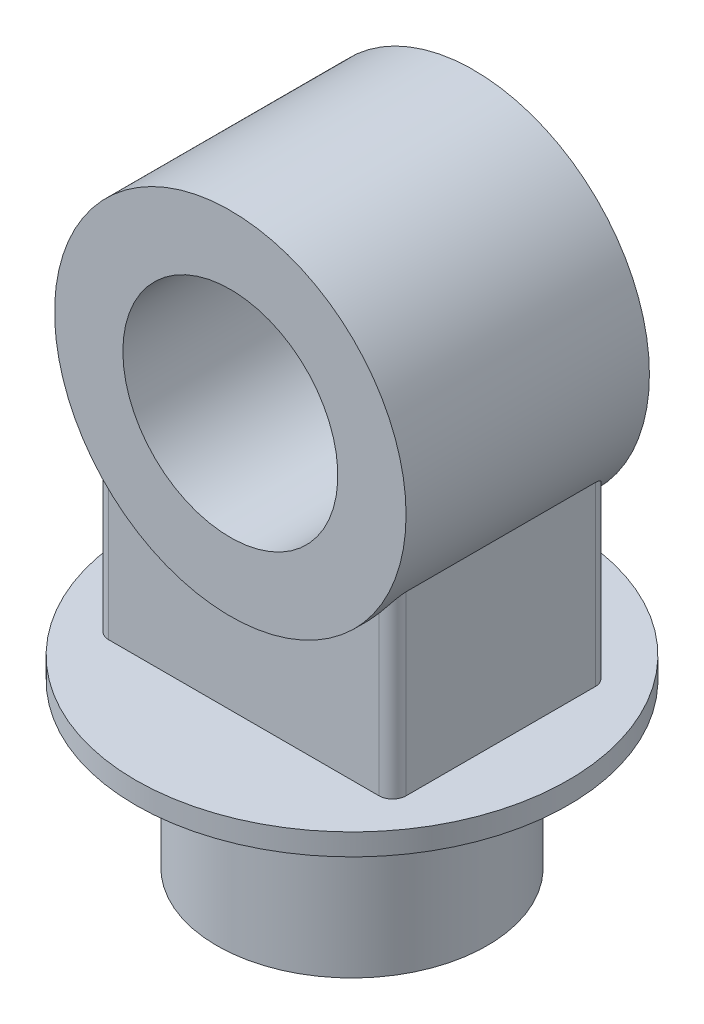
ISO-10303-21;
HEADER;
FILE_DESCRIPTION(('STEP AP214'),'2;1');
FILE_NAME('part.step','',(''),(''),'','','');
FILE_SCHEMA(('AUTOMOTIVE_DESIGN { 1 0 10303 214 1 1 1 1 }'));
ENDSEC;
DATA;
#1=APPLICATION_CONTEXT('core data for automotive mechanical design processes');
#2=APPLICATION_PROTOCOL_DEFINITION('international standard','automotive_design',2000,#1);
#3=PRODUCT_CONTEXT('',#1,'mechanical');
#4=PRODUCT('Part','Part','',(#3));
#5=PRODUCT_RELATED_PRODUCT_CATEGORY('part','',(#4));
#6=PRODUCT_DEFINITION_FORMATION('','',#4);
#7=PRODUCT_DEFINITION_CONTEXT('part definition',#1,'design');
#8=PRODUCT_DEFINITION('design','',#6,#7);
#9=PRODUCT_DEFINITION_SHAPE('','',#8);
#10=(LENGTH_UNIT() NAMED_UNIT(*) SI_UNIT(.MILLI.,.METRE.));
#11=(NAMED_UNIT(*) PLANE_ANGLE_UNIT() SI_UNIT($,.RADIAN.));
#12=(NAMED_UNIT(*) SI_UNIT($,.STERADIAN.) SOLID_ANGLE_UNIT());
#13=UNCERTAINTY_MEASURE_WITH_UNIT(LENGTH_MEASURE(1.E-05),#10,'distance_accuracy_value','');
#14=(GEOMETRIC_REPRESENTATION_CONTEXT(3) GLOBAL_UNCERTAINTY_ASSIGNED_CONTEXT((#13)) GLOBAL_UNIT_ASSIGNED_CONTEXT((#10,
#11,#12)) REPRESENTATION_CONTEXT('',''));
#15=CARTESIAN_POINT('',(0.,0.,0.));
#16=DIRECTION('',(0.,0.,1.));
#17=DIRECTION('',(1.,0.,0.));
#18=AXIS2_PLACEMENT_3D('',#15,#16,#17);
#19=CARTESIAN_POINT('',(0.,120.,0.));
#20=DIRECTION('',(0.,-1.,0.));
#21=DIRECTION('',(0.,0.,-1.));
#22=AXIS2_PLACEMENT_3D('',#19,#20,#21);
#23=CYLINDRICAL_SURFACE('',#22,100.);
#24=CARTESIAN_POINT('',(0.,120.,0.));
#25=DIRECTION('',(0.,1.,0.));
#26=DIRECTION('',(0.,0.,1.));
#27=AXIS2_PLACEMENT_3D('',#24,#25,#26);
#28=CIRCLE('',#27,100.);
#29=CARTESIAN_POINT('',(0.,120.,100.));
#30=VERTEX_POINT('',#29);
#31=EDGE_CURVE('E145',#30,#30,#28,.T.);
#32=ORIENTED_EDGE('',*,*,#31,.F.);
#33=EDGE_LOOP('',(#32));
#34=FACE_BOUND('',#33,.T.);
#35=CARTESIAN_POINT('',(0.,0.,0.));
#36=DIRECTION('',(0.,1.,0.));
#37=DIRECTION('',(0.,0.,1.));
#38=AXIS2_PLACEMENT_3D('',#35,#36,#37);
#39=CIRCLE('',#38,100.);
#40=CARTESIAN_POINT('',(0.,0.,100.));
#41=VERTEX_POINT('',#40);
#42=EDGE_CURVE('E231',#41,#41,#39,.T.);
#43=ORIENTED_EDGE('',*,*,#42,.T.);
#44=EDGE_LOOP('',(#43));
#45=FACE_BOUND('',#44,.T.);
#46=ADVANCED_FACE('F39',(#34,#45),#23,.T.);
#47=CARTESIAN_POINT('',(0.,0.,0.));
#48=DIRECTION('',(0.,1.,0.));
#49=DIRECTION('',(0.,0.,1.));
#50=AXIS2_PLACEMENT_3D('',#47,#48,#49);
#51=PLANE('',#50);
#52=ORIENTED_EDGE('',*,*,#42,.F.);
#53=EDGE_LOOP('',(#52));
#54=FACE_BOUND('',#53,.T.);
#55=ADVANCED_FACE('F243',(#54),#51,.F.);
#56=CARTESIAN_POINT('',(0.,136.,0.));
#57=DIRECTION('',(0.,-1.,0.));
#58=DIRECTION('',(0.,0.,-1.));
#59=AXIS2_PLACEMENT_3D('',#56,#57,#58);
#60=CYLINDRICAL_SURFACE('',#59,160.);
#61=CARTESIAN_POINT('',(0.,136.,0.));
#62=DIRECTION('',(0.,1.,0.));
#63=DIRECTION('',(0.,0.,1.));
#64=AXIS2_PLACEMENT_3D('',#61,#62,#63);
#65=CIRCLE('',#64,160.);
#66=CARTESIAN_POINT('',(0.,136.,160.));
#67=VERTEX_POINT('',#66);
#68=EDGE_CURVE('E227',#67,#67,#65,.T.);
#69=ORIENTED_EDGE('',*,*,#68,.F.);
#70=EDGE_LOOP('',(#69));
#71=FACE_BOUND('',#70,.T.);
#72=CARTESIAN_POINT('',(0.,120.,0.));
#73=DIRECTION('',(0.,1.,0.));
#74=DIRECTION('',(0.,0.,1.));
#75=AXIS2_PLACEMENT_3D('',#72,#73,#74);
#76=CIRCLE('',#75,160.);
#77=CARTESIAN_POINT('',(0.,120.,160.));
#78=VERTEX_POINT('',#77);
#79=EDGE_CURVE('E232',#78,#78,#76,.T.);
#80=ORIENTED_EDGE('',*,*,#79,.T.);
#81=EDGE_LOOP('',(#80));
#82=FACE_BOUND('',#81,.T.);
#83=ADVANCED_FACE('F245',(#71,#82),#60,.T.);
#84=CARTESIAN_POINT('',(0.,136.,0.));
#85=DIRECTION('',(0.,1.,0.));
#86=DIRECTION('',(0.,0.,1.));
#87=AXIS2_PLACEMENT_3D('',#84,#85,#86);
#88=PLANE('',#87);
#89=DIRECTION('',(0.,0.,-1.));
#90=VECTOR('',#89,1.);
#91=CARTESIAN_POINT('',(110.,136.,80.));
#92=LINE('',#91,#90);
#93=CARTESIAN_POINT('',(110.,136.,70.));
#94=VERTEX_POINT('',#93);
#95=CARTESIAN_POINT('',(110.,136.,-70.));
#96=VERTEX_POINT('',#95);
#97=EDGE_CURVE('E206',#94,#96,#92,.T.);
#98=ORIENTED_EDGE('',*,*,#97,.F.);
#99=CARTESIAN_POINT('',(99.9999999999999,136.,70.));
#100=DIRECTION('',(0.,1.,0.));
#101=DIRECTION('',(0.,0.,1.));
#102=AXIS2_PLACEMENT_3D('',#99,#100,#101);
#103=CIRCLE('',#102,10.);
#104=CARTESIAN_POINT('',(99.9999999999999,136.,80.));
#105=VERTEX_POINT('',#104);
#106=EDGE_CURVE('E54',#94,#105,#103,.F.);
#107=ORIENTED_EDGE('',*,*,#106,.T.);
#108=DIRECTION('',(1.,0.,0.));
#109=VECTOR('',#108,1.);
#110=CARTESIAN_POINT('',(-110.,136.,80.));
#111=LINE('',#110,#109);
#112=CARTESIAN_POINT('',(-100.,136.,80.));
#113=VERTEX_POINT('',#112);
#114=EDGE_CURVE('E205',#113,#105,#111,.T.);
#115=ORIENTED_EDGE('',*,*,#114,.F.);
#116=CARTESIAN_POINT('',(-100.,136.,70.));
#117=DIRECTION('',(0.,1.,0.));
#118=DIRECTION('',(0.,0.,1.));
#119=AXIS2_PLACEMENT_3D('',#116,#117,#118);
#120=CIRCLE('',#119,10.);
#121=CARTESIAN_POINT('',(-110.,136.,70.));
#122=VERTEX_POINT('',#121);
#123=EDGE_CURVE('E124',#113,#122,#120,.F.);
#124=ORIENTED_EDGE('',*,*,#123,.T.);
#125=DIRECTION('',(0.,0.,1.));
#126=VECTOR('',#125,1.);
#127=CARTESIAN_POINT('',(-110.,136.,80.));
#128=LINE('',#127,#126);
#129=CARTESIAN_POINT('',(-110.,136.,-70.));
#130=VERTEX_POINT('',#129);
#131=EDGE_CURVE('E208',#130,#122,#128,.T.);
#132=ORIENTED_EDGE('',*,*,#131,.F.);
#133=CARTESIAN_POINT('',(-100.,136.,-70.));
#134=DIRECTION('',(0.,1.,0.));
#135=DIRECTION('',(0.,0.,1.));
#136=AXIS2_PLACEMENT_3D('',#133,#134,#135);
#137=CIRCLE('',#136,10.);
#138=CARTESIAN_POINT('',(-100.,136.,-80.));
#139=VERTEX_POINT('',#138);
#140=EDGE_CURVE('E123',#130,#139,#137,.F.);
#141=ORIENTED_EDGE('',*,*,#140,.T.);
#142=DIRECTION('',(-1.,0.,0.));
#143=VECTOR('',#142,1.);
#144=CARTESIAN_POINT('',(-110.,136.,-80.));
#145=LINE('',#144,#143);
#146=CARTESIAN_POINT('',(99.9999999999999,136.,-80.));
#147=VERTEX_POINT('',#146);
#148=EDGE_CURVE('E273',#147,#139,#145,.T.);
#149=ORIENTED_EDGE('',*,*,#148,.F.);
#150=CARTESIAN_POINT('',(99.9999999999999,136.,-70.));
#151=DIRECTION('',(0.,1.,0.));
#152=DIRECTION('',(0.,0.,1.));
#153=AXIS2_PLACEMENT_3D('',#150,#151,#152);
#154=CIRCLE('',#153,10.);
#155=EDGE_CURVE('E61',#147,#96,#154,.F.);
#156=ORIENTED_EDGE('',*,*,#155,.T.);
#157=EDGE_LOOP('',(#98,#107,#115,#124,#132,#141,#149,#156));
#158=FACE_BOUND('',#157,.T.);
#159=ORIENTED_EDGE('',*,*,#68,.T.);
#160=EDGE_LOOP('',(#159));
#161=FACE_BOUND('',#160,.T.);
#162=ADVANCED_FACE('F203',(#158,#161),#88,.T.);
#163=CARTESIAN_POINT('',(0.,120.,0.));
#164=DIRECTION('',(0.,1.,0.));
#165=DIRECTION('',(0.,0.,1.));
#166=AXIS2_PLACEMENT_3D('',#163,#164,#165);
#167=PLANE('',#166);
#168=ORIENTED_EDGE('',*,*,#31,.T.);
#169=EDGE_LOOP('',(#168));
#170=FACE_BOUND('',#169,.T.);
#171=ORIENTED_EDGE('',*,*,#79,.F.);
#172=EDGE_LOOP('',(#171));
#173=FACE_BOUND('',#172,.T.);
#174=ADVANCED_FACE('F254',(#170,#173),#167,.F.);
#175=CARTESIAN_POINT('',(-110.,466.002,-80.));
#176=DIRECTION('',(0.,0.,1.));
#177=DIRECTION('',(1.,0.,0.));
#178=AXIS2_PLACEMENT_3D('',#175,#176,#177);
#179=PLANE('',#178);
#180=ORIENTED_EDGE('',*,*,#148,.T.);
#181=DIRECTION('',(0.,-1.,0.));
#182=VECTOR('',#181,1.);
#183=CARTESIAN_POINT('',(-100.,466.002,-80.));
#184=LINE('',#183,#182);
#185=CARTESIAN_POINT('',(-100.,252.933761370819,-80.));
#186=VERTEX_POINT('',#185);
#187=EDGE_CURVE('E155',#139,#186,#184,.F.);
#188=ORIENTED_EDGE('',*,*,#187,.T.);
#189=CARTESIAN_POINT('',(0.,336.,-80.));
#190=DIRECTION('',(0.,0.,1.));
#191=DIRECTION('',(1.,0.,0.));
#192=AXIS2_PLACEMENT_3D('',#189,#190,#191);
#193=CIRCLE('',#192,130.);
#194=CARTESIAN_POINT('',(99.9999999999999,252.933761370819,-80.));
#195=VERTEX_POINT('',#194);
#196=EDGE_CURVE('E218',#195,#186,#193,.F.);
#197=ORIENTED_EDGE('',*,*,#196,.F.);
#198=DIRECTION('',(0.,-1.,0.));
#199=VECTOR('',#198,1.);
#200=CARTESIAN_POINT('',(99.9999999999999,466.002,-80.));
#201=LINE('',#200,#199);
#202=EDGE_CURVE('E151',#195,#147,#201,.T.);
#203=ORIENTED_EDGE('',*,*,#202,.T.);
#204=EDGE_LOOP('',(#180,#188,#197,#203));
#205=FACE_BOUND('',#204,.T.);
#206=ADVANCED_FACE('F257',(#205),#179,.F.);
#207=CARTESIAN_POINT('',(110.,466.002,80.));
#208=DIRECTION('',(-1.,0.,0.));
#209=DIRECTION('',(0.,0.,1.));
#210=AXIS2_PLACEMENT_3D('',#207,#208,#209);
#211=PLANE('',#210);
#212=ORIENTED_EDGE('',*,*,#97,.T.);
#213=DIRECTION('',(0.,-1.,0.));
#214=VECTOR('',#213,1.);
#215=CARTESIAN_POINT('',(110.,466.002,-70.));
#216=LINE('',#215,#214);
#217=CARTESIAN_POINT('',(110.,266.717967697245,-70.));
#218=VERTEX_POINT('',#217);
#219=EDGE_CURVE('E161',#96,#218,#216,.F.);
#220=ORIENTED_EDGE('',*,*,#219,.T.);
#221=DIRECTION('',(0.,0.,-1.));
#222=VECTOR('',#221,1.);
#223=CARTESIAN_POINT('',(110.,266.717967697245,90.));
#224=LINE('',#223,#222);
#225=CARTESIAN_POINT('',(110.,266.717967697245,70.));
#226=VERTEX_POINT('',#225);
#227=EDGE_CURVE('E209',#226,#218,#224,.T.);
#228=ORIENTED_EDGE('',*,*,#227,.F.);
#229=DIRECTION('',(0.,-1.,0.));
#230=VECTOR('',#229,1.);
#231=CARTESIAN_POINT('',(110.,466.002,70.));
#232=LINE('',#231,#230);
#233=EDGE_CURVE('E158',#226,#94,#232,.T.);
#234=ORIENTED_EDGE('',*,*,#233,.T.);
#235=EDGE_LOOP('',(#212,#220,#228,#234));
#236=FACE_BOUND('',#235,.T.);
#237=ADVANCED_FACE('F215',(#236),#211,.F.);
#238=CARTESIAN_POINT('',(-110.,466.002,80.));
#239=DIRECTION('',(1.,0.,0.));
#240=DIRECTION('',(0.,0.,-1.));
#241=AXIS2_PLACEMENT_3D('',#238,#239,#240);
#242=PLANE('',#241);
#243=ORIENTED_EDGE('',*,*,#131,.T.);
#244=DIRECTION('',(0.,-1.,0.));
#245=VECTOR('',#244,1.);
#246=CARTESIAN_POINT('',(-110.,466.002,70.));
#247=LINE('',#246,#245);
#248=CARTESIAN_POINT('',(-110.,266.717967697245,70.));
#249=VERTEX_POINT('',#248);
#250=EDGE_CURVE('E143',#122,#249,#247,.F.);
#251=ORIENTED_EDGE('',*,*,#250,.T.);
#252=DIRECTION('',(0.,0.,-1.));
#253=VECTOR('',#252,1.);
#254=CARTESIAN_POINT('',(-110.,266.717967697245,90.));
#255=LINE('',#254,#253);
#256=CARTESIAN_POINT('',(-110.,266.717967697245,-70.));
#257=VERTEX_POINT('',#256);
#258=EDGE_CURVE('E118',#257,#249,#255,.F.);
#259=ORIENTED_EDGE('',*,*,#258,.F.);
#260=DIRECTION('',(0.,-1.,0.));
#261=VECTOR('',#260,1.);
#262=CARTESIAN_POINT('',(-110.,466.002,-70.));
#263=LINE('',#262,#261);
#264=EDGE_CURVE('E138',#257,#130,#263,.T.);
#265=ORIENTED_EDGE('',*,*,#264,.T.);
#266=EDGE_LOOP('',(#243,#251,#259,#265));
#267=FACE_BOUND('',#266,.T.);
#268=ADVANCED_FACE('F263',(#267),#242,.F.);
#269=CARTESIAN_POINT('',(-110.,466.002,80.));
#270=DIRECTION('',(0.,0.,-1.));
#271=DIRECTION('',(-1.,0.,0.));
#272=AXIS2_PLACEMENT_3D('',#269,#270,#271);
#273=PLANE('',#272);
#274=CARTESIAN_POINT('',(0.,336.,80.));
#275=DIRECTION('',(0.,0.,-1.));
#276=DIRECTION('',(-1.,0.,0.));
#277=AXIS2_PLACEMENT_3D('',#274,#275,#276);
#278=CIRCLE('',#277,130.);
#279=CARTESIAN_POINT('',(-100.,252.933761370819,80.));
#280=VERTEX_POINT('',#279);
#281=CARTESIAN_POINT('',(99.9999999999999,252.933761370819,80.));
#282=VERTEX_POINT('',#281);
#283=EDGE_CURVE('E115',#280,#282,#278,.F.);
#284=ORIENTED_EDGE('',*,*,#283,.F.);
#285=DIRECTION('',(0.,-1.,0.));
#286=VECTOR('',#285,1.);
#287=CARTESIAN_POINT('',(-100.,466.002,80.));
#288=LINE('',#287,#286);
#289=EDGE_CURVE('E130',#280,#113,#288,.T.);
#290=ORIENTED_EDGE('',*,*,#289,.T.);
#291=ORIENTED_EDGE('',*,*,#114,.T.);
#292=DIRECTION('',(0.,-1.,0.));
#293=VECTOR('',#292,1.);
#294=CARTESIAN_POINT('',(99.9999999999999,466.002,80.));
#295=LINE('',#294,#293);
#296=EDGE_CURVE('E132',#105,#282,#295,.F.);
#297=ORIENTED_EDGE('',*,*,#296,.T.);
#298=EDGE_LOOP('',(#284,#290,#291,#297));
#299=FACE_BOUND('',#298,.T.);
#300=ADVANCED_FACE('F128',(#299),#273,.F.);
#301=CARTESIAN_POINT('',(0.,336.,90.));
#302=DIRECTION('',(0.,0.,-1.));
#303=DIRECTION('',(-1.,0.,0.));
#304=AXIS2_PLACEMENT_3D('',#301,#302,#303);
#305=CYLINDRICAL_SURFACE('',#304,130.);
#306=CARTESIAN_POINT('',(0.,336.,90.));
#307=DIRECTION('',(0.,0.,1.));
#308=DIRECTION('',(1.,0.,0.));
#309=AXIS2_PLACEMENT_3D('',#306,#307,#308);
#310=CIRCLE('',#309,130.);
#311=CARTESIAN_POINT('',(130.,336.,90.));
#312=VERTEX_POINT('',#311);
#313=EDGE_CURVE('E134',#312,#312,#310,.T.);
#314=ORIENTED_EDGE('',*,*,#313,.F.);
#315=EDGE_LOOP('',(#314));
#316=FACE_BOUND('',#315,.T.);
#317=CARTESIAN_POINT('',(0.,336.,-90.));
#318=DIRECTION('',(0.,0.,1.));
#319=DIRECTION('',(1.,0.,0.));
#320=AXIS2_PLACEMENT_3D('',#317,#318,#319);
#321=CIRCLE('',#320,130.);
#322=CARTESIAN_POINT('',(130.,336.,-90.));
#323=VERTEX_POINT('',#322);
#324=EDGE_CURVE('E286',#323,#323,#321,.T.);
#325=ORIENTED_EDGE('',*,*,#324,.T.);
#326=EDGE_LOOP('',(#325));
#327=FACE_BOUND('',#326,.T.);
#328=ORIENTED_EDGE('',*,*,#283,.T.);
#329=CARTESIAN_POINT('',(99.9999999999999,252.933761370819,80.));
#330=CARTESIAN_POINT('',(100.223611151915,253.202952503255,79.9999830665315));
#331=CARTESIAN_POINT('',(100.446118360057,253.473036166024,79.9924995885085));
#332=CARTESIAN_POINT('',(100.888548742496,254.014496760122,79.9629173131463));
#333=CARTESIAN_POINT('',(101.108472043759,254.285873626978,79.9408192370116));
#334=CARTESIAN_POINT('',(101.545586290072,254.829711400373,79.8822979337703));
#335=CARTESIAN_POINT('',(101.76277446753,255.102173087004,79.8458612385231));
#336=CARTESIAN_POINT('',(102.193849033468,255.647413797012,79.7588609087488));
#337=CARTESIAN_POINT('',(102.407735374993,255.920192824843,79.7082970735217));
#338=CARTESIAN_POINT('',(103.048408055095,256.74400885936,79.5343891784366));
#339=CARTESIAN_POINT('',(103.469748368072,257.294974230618,79.3894263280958));
#340=CARTESIAN_POINT('',(104.088382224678,258.11722484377,79.1288060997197));
#341=CARTESIAN_POINT('',(104.292337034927,258.39057162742,79.0347525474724));
#342=CARTESIAN_POINT('',(104.695498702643,258.935304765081,78.8319429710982));
#343=CARTESIAN_POINT('',(104.894706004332,259.206691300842,78.7231883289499));
#344=CARTESIAN_POINT('',(105.336170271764,259.812965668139,78.4620472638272));
#345=CARTESIAN_POINT('',(105.577006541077,260.147108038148,78.3055009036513));
#346=CARTESIAN_POINT('',(106.04966094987,260.809343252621,77.967808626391));
#347=CARTESIAN_POINT('',(106.281479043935,261.137436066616,77.7866625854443));
#348=CARTESIAN_POINT('',(106.734152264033,261.784259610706,77.3986376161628));
#349=CARTESIAN_POINT('',(106.955036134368,262.103013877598,77.1918317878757));
#350=CARTESIAN_POINT('',(107.384708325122,262.728803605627,76.749894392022));
#351=CARTESIAN_POINT('',(107.593501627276,263.035843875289,76.5147746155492));
#352=CARTESIAN_POINT('',(107.921279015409,263.522080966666,76.1068757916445));
#353=CARTESIAN_POINT('',(108.044709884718,263.706240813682,75.9435605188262));
#354=CARTESIAN_POINT('',(108.284949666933,264.066582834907,75.6038296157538));
#355=CARTESIAN_POINT('',(108.401760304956,264.242767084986,75.4274174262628));
#356=CARTESIAN_POINT('',(108.627683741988,264.585236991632,75.0605773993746));
#357=CARTESIAN_POINT('',(108.736797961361,264.751524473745,74.8701521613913));
#358=CARTESIAN_POINT('',(108.945874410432,265.071634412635,74.4745306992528));
#359=CARTESIAN_POINT('',(109.04583974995,265.225461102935,74.2693395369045));
#360=CARTESIAN_POINT('',(109.274660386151,265.579056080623,73.7536743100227));
#361=CARTESIAN_POINT('',(109.398046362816,265.771031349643,73.4351396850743));
#362=CARTESIAN_POINT('',(109.561336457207,266.026263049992,72.9345418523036));
#363=CARTESIAN_POINT('',(109.612072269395,266.105785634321,72.7641622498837));
#364=CARTESIAN_POINT('',(109.705421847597,266.25239837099,72.4160328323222));
#365=CARTESIAN_POINT('',(109.748040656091,266.319496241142,72.2382876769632));
#366=CARTESIAN_POINT('',(109.820262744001,266.433384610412,71.8947331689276));
#367=CARTESIAN_POINT('',(109.850752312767,266.481551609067,71.729567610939));
#368=CARTESIAN_POINT('',(109.903691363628,266.565274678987,71.3948451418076));
#369=CARTESIAN_POINT('',(109.926143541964,266.600834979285,71.2252897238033));
#370=CARTESIAN_POINT('',(109.962659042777,266.658707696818,70.8807814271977));
#371=CARTESIAN_POINT('',(109.976613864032,266.680848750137,70.7057875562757));
#372=CARTESIAN_POINT('',(109.99061964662,266.703076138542,70.4419386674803));
#373=CARTESIAN_POINT('',(109.99413386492,266.708654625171,70.3536902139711));
#374=CARTESIAN_POINT('',(109.998824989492,266.716102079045,70.1769662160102));
#375=CARTESIAN_POINT('',(110.000001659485,266.717970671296,70.088490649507));
#376=CARTESIAN_POINT('',(110.,266.717967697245,70.));
#377=B_SPLINE_CURVE_WITH_KNOTS('',3,(#329,#330,#331,#332,#333,#334,#335,#336,#337,#338,#339,
#340,#341,#342,#343,#344,#345,#346,#347,#348,#349,#350,#351,#352,#353,#354,#355,#356,#357,#358,
#359,#360,#361,#362,#363,#364,#365,#366,#367,#368,#369,#370,#371,#372,#373,#374,#375,#376),
.UNSPECIFIED.,.F.,.F.,(4,2,2,2,2,2,2,2,2,2,2,2,2,2,2,2,2,2,2,2,2,2,2,4),(0.,1.04974156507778,
2.09943133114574,3.15010942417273,4.20080244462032,6.32356278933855,7.38465211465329,
8.44564176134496,9.76677685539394,11.087918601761,12.4053795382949,13.7222937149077,
14.5479419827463,15.3733741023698,16.1986534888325,17.0236513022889,18.1946866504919,
18.7783719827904,19.3616935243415,19.8852298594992,20.408590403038,20.9385006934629,
21.2038887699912,21.4693036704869),.UNSPECIFIED.);
#378=EDGE_CURVE('E11',#282,#226,#377,.T.);
#379=ORIENTED_EDGE('',*,*,#378,.T.);
#380=ORIENTED_EDGE('',*,*,#227,.T.);
#381=CARTESIAN_POINT('',(110.,266.717967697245,-70.));
#382=CARTESIAN_POINT('',(110.000033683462,266.718025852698,-70.1614230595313));
#383=CARTESIAN_POINT('',(109.996092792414,266.711764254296,-70.3228118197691));
#384=CARTESIAN_POINT('',(109.980519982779,266.687045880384,-70.6441123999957));
#385=CARTESIAN_POINT('',(109.968896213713,266.668602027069,-70.8040256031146));
#386=CARTESIAN_POINT('',(109.938376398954,266.620217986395,-71.1196424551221));
#387=CARTESIAN_POINT('',(109.919558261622,266.590400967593,-71.2753727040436));
#388=CARTESIAN_POINT('',(109.875071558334,266.52000006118,-71.5834085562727));
#389=CARTESIAN_POINT('',(109.849400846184,266.479412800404,-71.7357130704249));
#390=CARTESIAN_POINT('',(109.784772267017,266.377386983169,-72.0722520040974));
#391=CARTESIAN_POINT('',(109.744103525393,266.313281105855,-72.2553511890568));
#392=CARTESIAN_POINT('',(109.654040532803,266.171650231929,-72.6141464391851));
#393=CARTESIAN_POINT('',(109.604640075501,266.094115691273,-72.7898371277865));
#394=CARTESIAN_POINT('',(109.497968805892,265.927147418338,-73.133872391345));
#395=CARTESIAN_POINT('',(109.440667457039,265.837667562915,-73.302184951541));
#396=CARTESIAN_POINT('',(109.319341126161,265.648779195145,-73.6304969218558));
#397=CARTESIAN_POINT('',(109.25531768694,265.549372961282,-73.7904982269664));
#398=CARTESIAN_POINT('',(109.085069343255,265.285901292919,-74.1868876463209));
#399=CARTESIAN_POINT('',(108.974781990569,265.115997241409,-74.4176642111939));
#400=CARTESIAN_POINT('',(108.742772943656,264.76058359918,-74.8607110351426));
#401=CARTESIAN_POINT('',(108.621044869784,264.575065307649,-75.072970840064));
#402=CARTESIAN_POINT('',(108.36794946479,264.19164129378,-75.4804206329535));
#403=CARTESIAN_POINT('',(108.236568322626,263.993717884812,-75.6755852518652));
#404=CARTESIAN_POINT('',(107.965814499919,263.588382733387,-76.0497203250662));
#405=CARTESIAN_POINT('',(107.826442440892,263.380971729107,-76.2286920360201));
#406=CARTESIAN_POINT('',(107.56145650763,262.989174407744,-76.5468161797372));
#407=CARTESIAN_POINT('',(107.436764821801,262.805791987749,-76.6879854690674));
#408=CARTESIAN_POINT('',(107.182869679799,262.434497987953,-76.9599552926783));
#409=CARTESIAN_POINT('',(107.053665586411,262.24658576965,-77.0907543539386));
#410=CARTESIAN_POINT('',(106.659844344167,261.677121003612,-77.4685356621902));
#411=CARTESIAN_POINT('',(106.389102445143,261.289965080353,-77.7008024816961));
#412=CARTESIAN_POINT('',(105.833418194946,260.504836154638,-78.129863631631));
#413=CARTESIAN_POINT('',(105.548442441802,260.106838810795,-78.3265689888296));
#414=CARTESIAN_POINT('',(104.96676628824,259.304344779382,-78.6860846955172));
#415=CARTESIAN_POINT('',(104.670068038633,258.899849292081,-78.8489012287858));
#416=CARTESIAN_POINT('',(104.024574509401,258.030646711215,-79.1623550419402));
#417=CARTESIAN_POINT('',(103.674248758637,257.565348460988,-79.3081944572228));
#418=CARTESIAN_POINT('',(102.961876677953,256.632523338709,-79.558756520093));
#419=CARTESIAN_POINT('',(102.599828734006,256.16499616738,-79.6634734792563));
#420=CARTESIAN_POINT('',(102.051092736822,255.466397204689,-79.7891645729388));
#421=CARTESIAN_POINT('',(101.868137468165,255.235094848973,-79.8257282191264));
#422=CARTESIAN_POINT('',(101.499966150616,254.77288550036,-79.8886289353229));
#423=CARTESIAN_POINT('',(101.314750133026,254.541978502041,-79.9149661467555));
#424=CARTESIAN_POINT('',(100.942320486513,254.080919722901,-79.9572665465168));
#425=CARTESIAN_POINT('',(100.755107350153,253.850767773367,-79.9732322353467));
#426=CARTESIAN_POINT('',(100.378860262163,253.391449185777,-79.9945948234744));
#427=CARTESIAN_POINT('',(100.189826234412,253.162282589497,-79.9999912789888));
#428=CARTESIAN_POINT('',(99.9999999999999,252.933761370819,-80.));
#429=B_SPLINE_CURVE_WITH_KNOTS('',3,(#381,#382,#383,#384,#385,#386,#387,#388,#389,#390,#391,
#392,#393,#394,#395,#396,#397,#398,#399,#400,#401,#402,#403,#404,#405,#406,#407,#408,#409,#410,
#411,#412,#413,#414,#415,#416,#417,#418,#419,#420,#421,#422,#423,#424,#425,#426,#427,#428),
.UNSPECIFIED.,.F.,.F.,(4,2,2,2,2,2,2,2,2,2,2,2,2,2,2,2,2,2,2,2,2,2,2,4),(0.,0.484045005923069,
0.967577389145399,1.44601544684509,1.92460352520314,2.51835043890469,3.11252108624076,
3.7090561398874,4.30545457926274,5.22516595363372,6.1453932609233,7.06696382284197,
7.98846280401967,8.77680092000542,9.56525081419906,11.1426900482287,12.7240229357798,
14.305067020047,16.1047501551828,17.9046821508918,18.7960435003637,19.6873925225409,
20.5785265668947,21.4696980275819),.UNSPECIFIED.);
#430=EDGE_CURVE('E196',#218,#195,#429,.T.);
#431=ORIENTED_EDGE('',*,*,#430,.T.);
#432=ORIENTED_EDGE('',*,*,#196,.T.);
#433=CARTESIAN_POINT('',(-100.,252.933761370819,-80.));
#434=CARTESIAN_POINT('',(-100.223611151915,253.202952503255,-79.9999830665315));
#435=CARTESIAN_POINT('',(-100.446118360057,253.473036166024,-79.9924995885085));
#436=CARTESIAN_POINT('',(-100.888548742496,254.014496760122,-79.9629173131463));
#437=CARTESIAN_POINT('',(-101.10847204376,254.285873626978,-79.9408192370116));
#438=CARTESIAN_POINT('',(-101.545586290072,254.829711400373,-79.8822979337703));
#439=CARTESIAN_POINT('',(-101.76277446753,255.102173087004,-79.8458612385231));
#440=CARTESIAN_POINT('',(-102.193849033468,255.647413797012,-79.7588609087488));
#441=CARTESIAN_POINT('',(-102.407735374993,255.920192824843,-79.7082970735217));
#442=CARTESIAN_POINT('',(-103.048408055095,256.74400885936,-79.5343891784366));
#443=CARTESIAN_POINT('',(-103.469748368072,257.294974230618,-79.3894263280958));
#444=CARTESIAN_POINT('',(-104.088382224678,258.117224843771,-79.1288060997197));
#445=CARTESIAN_POINT('',(-104.292337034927,258.390571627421,-79.0347525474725));
#446=CARTESIAN_POINT('',(-104.695498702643,258.935304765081,-78.8319429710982));
#447=CARTESIAN_POINT('',(-104.894706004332,259.206691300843,-78.7231883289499));
#448=CARTESIAN_POINT('',(-105.336170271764,259.812965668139,-78.4620472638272));
#449=CARTESIAN_POINT('',(-105.577006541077,260.147108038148,-78.3055009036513));
#450=CARTESIAN_POINT('',(-106.049660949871,260.809343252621,-77.967808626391));
#451=CARTESIAN_POINT('',(-106.281479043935,261.137436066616,-77.7866625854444));
#452=CARTESIAN_POINT('',(-106.734152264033,261.784259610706,-77.3986376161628));
#453=CARTESIAN_POINT('',(-106.955036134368,262.103013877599,-77.1918317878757));
#454=CARTESIAN_POINT('',(-107.384708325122,262.728803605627,-76.749894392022));
#455=CARTESIAN_POINT('',(-107.593501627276,263.035843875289,-76.5147746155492));
#456=CARTESIAN_POINT('',(-107.921279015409,263.522080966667,-76.1068757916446));
#457=CARTESIAN_POINT('',(-108.044709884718,263.706240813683,-75.9435605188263));
#458=CARTESIAN_POINT('',(-108.284949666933,264.066582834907,-75.6038296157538));
#459=CARTESIAN_POINT('',(-108.401760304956,264.242767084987,-75.4274174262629));
#460=CARTESIAN_POINT('',(-108.627683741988,264.585236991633,-75.0605773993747));
#461=CARTESIAN_POINT('',(-108.736797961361,264.751524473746,-74.8701521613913));
#462=CARTESIAN_POINT('',(-108.945874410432,265.071634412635,-74.4745306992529));
#463=CARTESIAN_POINT('',(-109.04583974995,265.225461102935,-74.2693395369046));
#464=CARTESIAN_POINT('',(-109.274660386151,265.579056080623,-73.7536743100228));
#465=CARTESIAN_POINT('',(-109.398046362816,265.771031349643,-73.4351396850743));
#466=CARTESIAN_POINT('',(-109.561336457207,266.026263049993,-72.9345418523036));
#467=CARTESIAN_POINT('',(-109.612072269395,266.105785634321,-72.7641622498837));
#468=CARTESIAN_POINT('',(-109.705421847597,266.25239837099,-72.4160328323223));
#469=CARTESIAN_POINT('',(-109.748040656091,266.319496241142,-72.2382876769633));
#470=CARTESIAN_POINT('',(-109.820262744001,266.433384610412,-71.8947331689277));
#471=CARTESIAN_POINT('',(-109.850752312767,266.481551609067,-71.729567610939));
#472=CARTESIAN_POINT('',(-109.903691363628,266.565274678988,-71.3948451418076));
#473=CARTESIAN_POINT('',(-109.926143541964,266.600834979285,-71.2252897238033));
#474=CARTESIAN_POINT('',(-109.962659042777,266.658707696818,-70.8807814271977));
#475=CARTESIAN_POINT('',(-109.976613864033,266.680848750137,-70.7057875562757));
#476=CARTESIAN_POINT('',(-109.99061964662,266.703076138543,-70.4419386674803));
#477=CARTESIAN_POINT('',(-109.99413386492,266.708654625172,-70.3536902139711));
#478=CARTESIAN_POINT('',(-109.998824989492,266.716102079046,-70.1769662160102));
#479=CARTESIAN_POINT('',(-110.000001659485,266.717970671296,-70.0884906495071));
#480=CARTESIAN_POINT('',(-110.,266.717967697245,-70.));
#481=B_SPLINE_CURVE_WITH_KNOTS('',3,(#433,#434,#435,#436,#437,#438,#439,#440,#441,#442,#443,
#444,#445,#446,#447,#448,#449,#450,#451,#452,#453,#454,#455,#456,#457,#458,#459,#460,#461,#462,
#463,#464,#465,#466,#467,#468,#469,#470,#471,#472,#473,#474,#475,#476,#477,#478,#479,#480),
.UNSPECIFIED.,.F.,.F.,(4,2,2,2,2,2,2,2,2,2,2,2,2,2,2,2,2,2,2,2,2,2,2,4),(0.,1.04974156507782,
2.09943133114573,3.15010942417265,4.20080244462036,6.32356278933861,7.38465211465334,
8.44564176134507,9.76677685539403,11.087918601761,12.4053795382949,13.7222937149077,
14.5479419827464,15.3733741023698,16.1986534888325,17.0236513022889,18.1946866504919,
18.7783719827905,19.3616935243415,19.8852298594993,20.4085904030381,20.9385006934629,
21.2038887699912,21.4693036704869),.UNSPECIFIED.);
#482=EDGE_CURVE('E187',#186,#257,#481,.T.);
#483=ORIENTED_EDGE('',*,*,#482,.T.);
#484=ORIENTED_EDGE('',*,*,#258,.T.);
#485=CARTESIAN_POINT('',(-110.,266.717967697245,70.));
#486=CARTESIAN_POINT('',(-110.000033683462,266.718025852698,70.1614230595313));
#487=CARTESIAN_POINT('',(-109.996092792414,266.711764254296,70.3228118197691));
#488=CARTESIAN_POINT('',(-109.980519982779,266.687045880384,70.6441123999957));
#489=CARTESIAN_POINT('',(-109.968896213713,266.668602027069,70.8040256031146));
#490=CARTESIAN_POINT('',(-109.938376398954,266.620217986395,71.1196424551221));
#491=CARTESIAN_POINT('',(-109.919558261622,266.590400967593,71.2753727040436));
#492=CARTESIAN_POINT('',(-109.875071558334,266.52000006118,71.5834085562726));
#493=CARTESIAN_POINT('',(-109.849400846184,266.479412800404,71.7357130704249));
#494=CARTESIAN_POINT('',(-109.784772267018,266.377386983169,72.0722520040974));
#495=CARTESIAN_POINT('',(-109.744103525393,266.313281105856,72.2553511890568));
#496=CARTESIAN_POINT('',(-109.654040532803,266.17165023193,72.6141464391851));
#497=CARTESIAN_POINT('',(-109.604640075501,266.094115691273,72.7898371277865));
#498=CARTESIAN_POINT('',(-109.497968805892,265.927147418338,73.1338723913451));
#499=CARTESIAN_POINT('',(-109.440667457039,265.837667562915,73.3021849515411));
#500=CARTESIAN_POINT('',(-109.319341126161,265.648779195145,73.6304969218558));
#501=CARTESIAN_POINT('',(-109.25531768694,265.549372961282,73.7904982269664));
#502=CARTESIAN_POINT('',(-109.085069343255,265.28590129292,74.1868876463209));
#503=CARTESIAN_POINT('',(-108.974781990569,265.115997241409,74.4176642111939));
#504=CARTESIAN_POINT('',(-108.742772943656,264.76058359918,74.8607110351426));
#505=CARTESIAN_POINT('',(-108.621044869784,264.575065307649,75.072970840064));
#506=CARTESIAN_POINT('',(-108.36794946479,264.19164129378,75.4804206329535));
#507=CARTESIAN_POINT('',(-108.236568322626,263.993717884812,75.6755852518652));
#508=CARTESIAN_POINT('',(-107.965814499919,263.588382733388,76.0497203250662));
#509=CARTESIAN_POINT('',(-107.826442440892,263.380971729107,76.2286920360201));
#510=CARTESIAN_POINT('',(-107.56145650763,262.989174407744,76.5468161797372));
#511=CARTESIAN_POINT('',(-107.436764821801,262.805791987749,76.6879854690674));
#512=CARTESIAN_POINT('',(-107.182869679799,262.434497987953,76.9599552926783));
#513=CARTESIAN_POINT('',(-107.053665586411,262.24658576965,77.0907543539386));
#514=CARTESIAN_POINT('',(-106.659844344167,261.677121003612,77.4685356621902));
#515=CARTESIAN_POINT('',(-106.389102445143,261.289965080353,77.7008024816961));
#516=CARTESIAN_POINT('',(-105.833418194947,260.504836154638,78.129863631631));
#517=CARTESIAN_POINT('',(-105.548442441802,260.106838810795,78.3265689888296));
#518=CARTESIAN_POINT('',(-104.96676628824,259.304344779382,78.6860846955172));
#519=CARTESIAN_POINT('',(-104.670068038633,258.899849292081,78.8489012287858));
#520=CARTESIAN_POINT('',(-104.024574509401,258.030646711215,79.1623550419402));
#521=CARTESIAN_POINT('',(-103.674248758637,257.565348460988,79.3081944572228));
#522=CARTESIAN_POINT('',(-102.961876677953,256.632523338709,79.558756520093));
#523=CARTESIAN_POINT('',(-102.599828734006,256.16499616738,79.6634734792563));
#524=CARTESIAN_POINT('',(-102.051092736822,255.46639720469,79.7891645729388));
#525=CARTESIAN_POINT('',(-101.868137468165,255.235094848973,79.8257282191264));
#526=CARTESIAN_POINT('',(-101.499966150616,254.772885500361,79.8886289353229));
#527=CARTESIAN_POINT('',(-101.314750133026,254.541978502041,79.9149661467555));
#528=CARTESIAN_POINT('',(-100.942320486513,254.080919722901,79.9572665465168));
#529=CARTESIAN_POINT('',(-100.755107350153,253.850767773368,79.9732322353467));
#530=CARTESIAN_POINT('',(-100.378860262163,253.391449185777,79.9945948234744));
#531=CARTESIAN_POINT('',(-100.189826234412,253.162282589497,79.9999912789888));
#532=CARTESIAN_POINT('',(-100.,252.933761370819,80.));
#533=B_SPLINE_CURVE_WITH_KNOTS('',3,(#485,#486,#487,#488,#489,#490,#491,#492,#493,#494,#495,
#496,#497,#498,#499,#500,#501,#502,#503,#504,#505,#506,#507,#508,#509,#510,#511,#512,#513,#514,
#515,#516,#517,#518,#519,#520,#521,#522,#523,#524,#525,#526,#527,#528,#529,#530,#531,#532),
.UNSPECIFIED.,.F.,.F.,(4,2,2,2,2,2,2,2,2,2,2,2,2,2,2,2,2,2,2,2,2,2,2,4),(0.,0.484045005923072,
0.967577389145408,1.44601544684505,1.92460352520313,2.51835043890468,3.11252108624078,
3.70905613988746,4.30545457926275,5.22516595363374,6.14539326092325,7.06696382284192,
7.98846280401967,8.7768009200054,9.565250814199,11.1426900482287,12.7240229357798,
14.3050670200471,16.1047501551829,17.9046821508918,18.7960435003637,19.6873925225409,
20.5785265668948,21.4696980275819),.UNSPECIFIED.);
#534=EDGE_CURVE('E112',#249,#280,#533,.T.);
#535=ORIENTED_EDGE('',*,*,#534,.T.);
#536=EDGE_LOOP('',(#328,#379,#380,#431,#432,#483,#484,#535));
#537=FACE_BOUND('',#536,.T.);
#538=ADVANCED_FACE('F114',(#316,#327,#537),#305,.T.);
#539=CARTESIAN_POINT('',(0.,336.,90.));
#540=DIRECTION('',(0.,0.,1.));
#541=DIRECTION('',(1.,0.,0.));
#542=AXIS2_PLACEMENT_3D('',#539,#540,#541);
#543=PLANE('',#542);
#544=ORIENTED_EDGE('',*,*,#313,.T.);
#545=EDGE_LOOP('',(#544));
#546=FACE_BOUND('',#545,.T.);
#547=CARTESIAN_POINT('',(0.,336.,90.));
#548=DIRECTION('',(0.,0.,1.));
#549=DIRECTION('',(1.,0.,0.));
#550=AXIS2_PLACEMENT_3D('',#547,#548,#549);
#551=CIRCLE('',#550,79.5);
#552=CARTESIAN_POINT('',(-79.5,336.,90.));
#553=VERTEX_POINT('',#552);
#554=EDGE_CURVE('E407',#553,#553,#551,.T.);
#555=ORIENTED_EDGE('',*,*,#554,.F.);
#556=EDGE_LOOP('',(#555));
#557=FACE_BOUND('',#556,.T.);
#558=ADVANCED_FACE('F323',(#546,#557),#543,.T.);
#559=CARTESIAN_POINT('',(0.,336.,-90.));
#560=DIRECTION('',(0.,0.,1.));
#561=DIRECTION('',(1.,0.,0.));
#562=AXIS2_PLACEMENT_3D('',#559,#560,#561);
#563=PLANE('',#562);
#564=ORIENTED_EDGE('',*,*,#324,.F.);
#565=EDGE_LOOP('',(#564));
#566=FACE_BOUND('',#565,.T.);
#567=CARTESIAN_POINT('',(0.,336.,-90.));
#568=DIRECTION('',(0.,0.,1.));
#569=DIRECTION('',(1.,0.,0.));
#570=AXIS2_PLACEMENT_3D('',#567,#568,#569);
#571=CIRCLE('',#570,79.5);
#572=CARTESIAN_POINT('',(-79.5,336.,-90.));
#573=VERTEX_POINT('',#572);
#574=EDGE_CURVE('E409',#573,#573,#571,.T.);
#575=ORIENTED_EDGE('',*,*,#574,.T.);
#576=EDGE_LOOP('',(#575));
#577=FACE_BOUND('',#576,.T.);
#578=ADVANCED_FACE('F362',(#566,#577),#563,.F.);
#579=CARTESIAN_POINT('',(0.,336.,90.));
#580=DIRECTION('',(0.,0.,-1.));
#581=DIRECTION('',(-1.,0.,0.));
#582=AXIS2_PLACEMENT_3D('',#579,#580,#581);
#583=CYLINDRICAL_SURFACE('',#582,79.5);
#584=CARTESIAN_POINT('',(-79.5,336.,90.));
#585=CARTESIAN_POINT('',(-79.5,336.,88.125));
#586=CARTESIAN_POINT('',(-79.5,336.,86.25));
#587=CARTESIAN_POINT('',(-79.5,336.,82.5));
#588=CARTESIAN_POINT('',(-79.5,336.,80.625));
#589=CARTESIAN_POINT('',(-79.5,336.,76.875));
#590=CARTESIAN_POINT('',(-79.5,336.,75.));
#591=CARTESIAN_POINT('',(-79.5,336.,71.25));
#592=CARTESIAN_POINT('',(-79.5,336.,69.375));
#593=CARTESIAN_POINT('',(-79.5,336.,65.625));
#594=CARTESIAN_POINT('',(-79.5,336.,63.75));
#595=CARTESIAN_POINT('',(-79.5,336.,60.));
#596=CARTESIAN_POINT('',(-79.5,336.,58.125));
#597=CARTESIAN_POINT('',(-79.5,336.,54.375));
#598=CARTESIAN_POINT('',(-79.5,336.,52.5));
#599=CARTESIAN_POINT('',(-79.5,336.,48.75));
#600=CARTESIAN_POINT('',(-79.5,336.,46.875));
#601=CARTESIAN_POINT('',(-79.5,336.,43.125));
#602=CARTESIAN_POINT('',(-79.5,336.,41.25));
#603=CARTESIAN_POINT('',(-79.5,336.,37.5));
#604=CARTESIAN_POINT('',(-79.5,336.,35.625));
#605=CARTESIAN_POINT('',(-79.5,336.,31.875));
#606=CARTESIAN_POINT('',(-79.5,336.,30.));
#607=CARTESIAN_POINT('',(-79.5,336.,26.25));
#608=CARTESIAN_POINT('',(-79.5,336.,24.375));
#609=CARTESIAN_POINT('',(-79.5,336.,20.625));
#610=CARTESIAN_POINT('',(-79.5,336.,18.75));
#611=CARTESIAN_POINT('',(-79.5,336.,15.));
#612=CARTESIAN_POINT('',(-79.5,336.,13.125));
#613=CARTESIAN_POINT('',(-79.5,336.,9.37499999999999));
#614=CARTESIAN_POINT('',(-79.5,336.,7.49999999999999));
#615=CARTESIAN_POINT('',(-79.5,336.,3.74999999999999));
#616=CARTESIAN_POINT('',(-79.5,336.,1.87499999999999));
#617=CARTESIAN_POINT('',(-79.5,336.,-1.87500000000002));
#618=CARTESIAN_POINT('',(-79.5,336.,-3.75000000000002));
#619=CARTESIAN_POINT('',(-79.5,336.,-7.50000000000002));
#620=CARTESIAN_POINT('',(-79.5,336.,-9.37500000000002));
#621=CARTESIAN_POINT('',(-79.5,336.,-13.125));
#622=CARTESIAN_POINT('',(-79.5,336.,-15.));
#623=CARTESIAN_POINT('',(-79.5,336.,-18.75));
#624=CARTESIAN_POINT('',(-79.5,336.,-20.625));
#625=CARTESIAN_POINT('',(-79.5,336.,-24.375));
#626=CARTESIAN_POINT('',(-79.5,336.,-26.25));
#627=CARTESIAN_POINT('',(-79.5,336.,-30.));
#628=CARTESIAN_POINT('',(-79.5,336.,-31.875));
#629=CARTESIAN_POINT('',(-79.5,336.,-35.625));
#630=CARTESIAN_POINT('',(-79.5,336.,-37.5));
#631=CARTESIAN_POINT('',(-79.5,336.,-41.25));
#632=CARTESIAN_POINT('',(-79.5,336.,-43.125));
#633=CARTESIAN_POINT('',(-79.5,336.,-46.875));
#634=CARTESIAN_POINT('',(-79.5,336.,-48.75));
#635=CARTESIAN_POINT('',(-79.5,336.,-52.5));
#636=CARTESIAN_POINT('',(-79.5,336.,-54.375));
#637=CARTESIAN_POINT('',(-79.5,336.,-58.125));
#638=CARTESIAN_POINT('',(-79.5,336.,-60.));
#639=CARTESIAN_POINT('',(-79.5,336.,-63.75));
#640=CARTESIAN_POINT('',(-79.5,336.,-65.625));
#641=CARTESIAN_POINT('',(-79.5,336.,-69.375));
#642=CARTESIAN_POINT('',(-79.5,336.,-71.25));
#643=CARTESIAN_POINT('',(-79.5,336.,-75.));
#644=CARTESIAN_POINT('',(-79.5,336.,-76.875));
#645=CARTESIAN_POINT('',(-79.5,336.,-80.625));
#646=CARTESIAN_POINT('',(-79.5,336.,-82.5));
#647=CARTESIAN_POINT('',(-79.5,336.,-86.25));
#648=CARTESIAN_POINT('',(-79.5,336.,-88.125));
#649=CARTESIAN_POINT('',(-79.5,336.,-90.));
#650=B_SPLINE_CURVE_WITH_KNOTS('',3,(#584,#585,#586,#587,#588,#589,#590,#591,#592,#593,#594,
#595,#596,#597,#598,#599,#600,#601,#602,#603,#604,#605,#606,#607,#608,#609,#610,#611,#612,#613,
#614,#615,#616,#617,#618,#619,#620,#621,#622,#623,#624,#625,#626,#627,#628,#629,#630,#631,#632,
#633,#634,#635,#636,#637,#638,#639,#640,#641,#642,#643,#644,#645,#646,#647,#648,#649),
.UNSPECIFIED.,.F.,.F.,(4,2,2,2,2,2,2,2,2,2,2,2,2,2,2,2,2,2,2,2,2,2,2,2,2,2,2,2,2,2,2,2,4),(0.,
5.62500000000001,11.25,16.875,22.5,28.125,33.75,39.375,45.,50.625,56.25,61.875,67.5,73.125,
78.75,84.375,90.,95.625,101.25,106.875,112.5,118.125,123.75,129.375,135.,140.625,146.25,151.875,
157.5,163.125,168.75,174.375,180.),.UNSPECIFIED.);
#651=EDGE_CURVE('BSEAM180',#553,#573,#650,.T.);
#652=ORIENTED_EDGE('',*,*,#554,.T.);
#653=ORIENTED_EDGE('',*,*,#574,.F.);
#654=ORIENTED_EDGE('',*,*,#651,.T.);
#655=ORIENTED_EDGE('',*,*,#651,.F.);
#656=EDGE_LOOP('',(#652,#654,#653,#655));
#657=FACE_BOUND('',#656,.T.);
#658=ADVANCED_FACE('F180',(#657),#583,.F.);
#659=CARTESIAN_POINT('',(-100.,466.002,70.));
#660=DIRECTION('',(0.,-1.,0.));
#661=DIRECTION('',(0.,0.,-1.));
#662=AXIS2_PLACEMENT_3D('',#659,#660,#661);
#663=CYLINDRICAL_SURFACE('',#662,10.);
#664=ORIENTED_EDGE('',*,*,#534,.F.);
#665=ORIENTED_EDGE('',*,*,#250,.F.);
#666=ORIENTED_EDGE('',*,*,#123,.F.);
#667=ORIENTED_EDGE('',*,*,#289,.F.);
#668=EDGE_LOOP('',(#664,#665,#666,#667));
#669=FACE_BOUND('',#668,.T.);
#670=ADVANCED_FACE('F136',(#669),#663,.T.);
#671=CARTESIAN_POINT('',(-100.,466.002,-70.));
#672=DIRECTION('',(0.,-1.,0.));
#673=DIRECTION('',(0.,0.,-1.));
#674=AXIS2_PLACEMENT_3D('',#671,#672,#673);
#675=CYLINDRICAL_SURFACE('',#674,10.);
#676=ORIENTED_EDGE('',*,*,#482,.F.);
#677=ORIENTED_EDGE('',*,*,#187,.F.);
#678=ORIENTED_EDGE('',*,*,#140,.F.);
#679=ORIENTED_EDGE('',*,*,#264,.F.);
#680=EDGE_LOOP('',(#676,#677,#678,#679));
#681=FACE_BOUND('',#680,.T.);
#682=ADVANCED_FACE('F179',(#681),#675,.T.);
#683=CARTESIAN_POINT('',(99.9999999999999,466.002,-70.));
#684=DIRECTION('',(0.,-1.,0.));
#685=DIRECTION('',(0.,0.,-1.));
#686=AXIS2_PLACEMENT_3D('',#683,#684,#685);
#687=CYLINDRICAL_SURFACE('',#686,10.);
#688=ORIENTED_EDGE('',*,*,#430,.F.);
#689=ORIENTED_EDGE('',*,*,#219,.F.);
#690=ORIENTED_EDGE('',*,*,#155,.F.);
#691=ORIENTED_EDGE('',*,*,#202,.F.);
#692=EDGE_LOOP('',(#688,#689,#690,#691));
#693=FACE_BOUND('',#692,.T.);
#694=ADVANCED_FACE('F184',(#693),#687,.T.);
#695=CARTESIAN_POINT('',(99.9999999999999,466.002,70.));
#696=DIRECTION('',(0.,-1.,0.));
#697=DIRECTION('',(0.,0.,-1.));
#698=AXIS2_PLACEMENT_3D('',#695,#696,#697);
#699=CYLINDRICAL_SURFACE('',#698,10.);
#700=ORIENTED_EDGE('',*,*,#378,.F.);
#701=ORIENTED_EDGE('',*,*,#296,.F.);
#702=ORIENTED_EDGE('',*,*,#106,.F.);
#703=ORIENTED_EDGE('',*,*,#233,.F.);
#704=EDGE_LOOP('',(#700,#701,#702,#703));
#705=FACE_BOUND('',#704,.T.);
#706=ADVANCED_FACE('F41',(#705),#699,.T.);
#707=CLOSED_SHELL('',(#46,#55,#83,#162,#174,#206,#237,#268,#300,#538,#558,#578,#658,#670,#682,
#694,#706));
#708=MANIFOLD_SOLID_BREP('B2',#707);
#709=ADVANCED_BREP_SHAPE_REPRESENTATION('',(#18,#708),#14);
#710=SHAPE_DEFINITION_REPRESENTATION(#9,#709);
ENDSEC;
END-ISO-10303-21;
